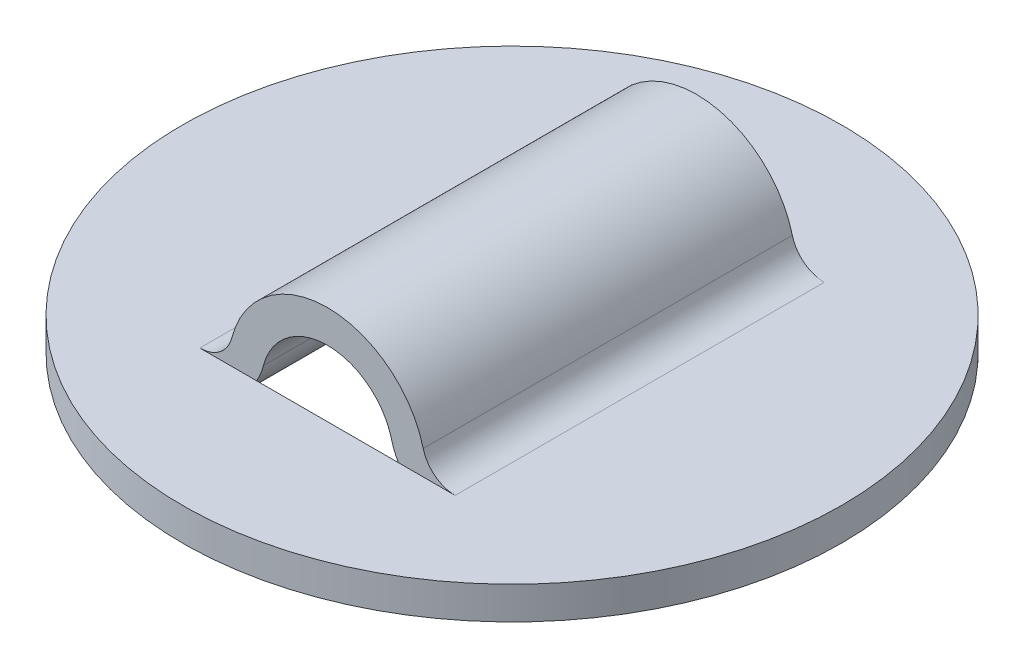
ISO-10303-21;
HEADER;
FILE_DESCRIPTION(('STEP AP214'),'2;1');
FILE_NAME('part.step','',(''),(''),'','','');
FILE_SCHEMA(('AUTOMOTIVE_DESIGN { 1 0 10303 214 1 1 1 1 }'));
ENDSEC;
DATA;
#1=APPLICATION_CONTEXT('core data for automotive mechanical design processes');
#2=APPLICATION_PROTOCOL_DEFINITION('international standard','automotive_design',2000,#1);
#3=PRODUCT_CONTEXT('',#1,'mechanical');
#4=PRODUCT('Part','Part','',(#3));
#5=PRODUCT_RELATED_PRODUCT_CATEGORY('part','',(#4));
#6=PRODUCT_DEFINITION_FORMATION('','',#4);
#7=PRODUCT_DEFINITION_CONTEXT('part definition',#1,'design');
#8=PRODUCT_DEFINITION('design','',#6,#7);
#9=PRODUCT_DEFINITION_SHAPE('','',#8);
#10=(LENGTH_UNIT() NAMED_UNIT(*) SI_UNIT(.MILLI.,.METRE.));
#11=(NAMED_UNIT(*) PLANE_ANGLE_UNIT() SI_UNIT($,.RADIAN.));
#12=(NAMED_UNIT(*) SI_UNIT($,.STERADIAN.) SOLID_ANGLE_UNIT());
#13=UNCERTAINTY_MEASURE_WITH_UNIT(LENGTH_MEASURE(1.E-05),#10,'distance_accuracy_value','');
#14=(GEOMETRIC_REPRESENTATION_CONTEXT(3) GLOBAL_UNCERTAINTY_ASSIGNED_CONTEXT((#13)) GLOBAL_UNIT_ASSIGNED_CONTEXT((#10,
#11,#12)) REPRESENTATION_CONTEXT('',''));
#15=CARTESIAN_POINT('',(0.,0.,0.));
#16=DIRECTION('',(0.,0.,1.));
#17=DIRECTION('',(1.,0.,0.));
#18=AXIS2_PLACEMENT_3D('',#15,#16,#17);
#19=CARTESIAN_POINT('',(0.,0.,17.78));
#20=DIRECTION('',(0.,0.,-1.));
#21=DIRECTION('',(-1.,0.,0.));
#22=AXIS2_PLACEMENT_3D('',#19,#20,#21);
#23=CYLINDRICAL_SURFACE('',#22,4.7625);
#24=CARTESIAN_POINT('',(0.,0.,0.));
#25=DIRECTION('',(0.,0.,-1.));
#26=DIRECTION('',(-1.,0.,0.));
#27=AXIS2_PLACEMENT_3D('',#24,#25,#26);
#28=CIRCLE('',#27,4.7625);
#29=CARTESIAN_POINT('',(-4.61127079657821,1.190625,0.));
#30=VERTEX_POINT('',#29);
#31=CARTESIAN_POINT('',(4.61127079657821,1.190625,0.));
#32=VERTEX_POINT('',#31);
#33=EDGE_CURVE('E163',#30,#32,#28,.T.);
#34=ORIENTED_EDGE('',*,*,#33,.F.);
#35=DIRECTION('',(0.,0.,-1.));
#36=VECTOR('',#35,1.);
#37=CARTESIAN_POINT('',(-4.61127079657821,1.190625,17.78));
#38=LINE('',#37,#36);
#39=CARTESIAN_POINT('',(-4.61127079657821,1.190625,17.78));
#40=VERTEX_POINT('',#39);
#41=EDGE_CURVE('E126',#30,#40,#38,.F.);
#42=ORIENTED_EDGE('',*,*,#41,.T.);
#43=CARTESIAN_POINT('',(0.,0.,17.78));
#44=DIRECTION('',(0.,0.,-1.));
#45=DIRECTION('',(-1.,0.,0.));
#46=AXIS2_PLACEMENT_3D('',#43,#44,#45);
#47=CIRCLE('',#46,4.7625);
#48=CARTESIAN_POINT('',(4.61127079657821,1.190625,17.78));
#49=VERTEX_POINT('',#48);
#50=EDGE_CURVE('E98',#40,#49,#47,.T.);
#51=ORIENTED_EDGE('',*,*,#50,.T.);
#52=DIRECTION('',(0.,0.,-1.));
#53=VECTOR('',#52,1.);
#54=CARTESIAN_POINT('',(4.61127079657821,1.190625,17.78));
#55=LINE('',#54,#53);
#56=EDGE_CURVE('E101',#49,#32,#55,.T.);
#57=ORIENTED_EDGE('',*,*,#56,.T.);
#58=EDGE_LOOP('',(#34,#42,#51,#57));
#59=FACE_BOUND('',#58,.T.);
#60=ADVANCED_FACE('F18',(#59),#23,.T.);
#61=CARTESIAN_POINT('',(-6.14836106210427,1.5875,17.78));
#62=DIRECTION('',(0.,0.,-1.));
#63=DIRECTION('',(-1.,0.,0.));
#64=AXIS2_PLACEMENT_3D('',#61,#62,#63);
#65=CYLINDRICAL_SURFACE('',#64,1.5875);
#66=CARTESIAN_POINT('',(-6.14836106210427,1.5875,17.78));
#67=DIRECTION('',(0.,0.,-1.));
#68=DIRECTION('',(-1.,0.,0.));
#69=AXIS2_PLACEMENT_3D('',#66,#67,#68);
#70=CIRCLE('',#69,1.5875);
#71=CARTESIAN_POINT('',(-6.14836106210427,0.,17.78));
#72=VERTEX_POINT('',#71);
#73=EDGE_CURVE('E21',#72,#40,#70,.F.);
#74=ORIENTED_EDGE('',*,*,#73,.T.);
#75=ORIENTED_EDGE('',*,*,#41,.F.);
#76=CARTESIAN_POINT('',(-6.14836106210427,1.5875,0.));
#77=DIRECTION('',(0.,0.,-1.));
#78=DIRECTION('',(-1.,0.,0.));
#79=AXIS2_PLACEMENT_3D('',#76,#77,#78);
#80=CIRCLE('',#79,1.5875);
#81=CARTESIAN_POINT('',(-6.14836106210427,0.,0.));
#82=VERTEX_POINT('',#81);
#83=EDGE_CURVE('E117',#82,#30,#80,.F.);
#84=ORIENTED_EDGE('',*,*,#83,.F.);
#85=DIRECTION('',(0.,0.,1.));
#86=VECTOR('',#85,1.);
#87=CARTESIAN_POINT('',(-6.14836106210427,0.,17.78));
#88=LINE('',#87,#86);
#89=EDGE_CURVE('E108',#82,#72,#88,.T.);
#90=ORIENTED_EDGE('',*,*,#89,.T.);
#91=EDGE_LOOP('',(#74,#75,#84,#90));
#92=FACE_BOUND('',#91,.T.);
#93=ADVANCED_FACE('F115',(#92),#65,.F.);
#94=CARTESIAN_POINT('',(6.14836106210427,1.5875,17.78));
#95=DIRECTION('',(0.,0.,-1.));
#96=DIRECTION('',(-1.,0.,0.));
#97=AXIS2_PLACEMENT_3D('',#94,#95,#96);
#98=CYLINDRICAL_SURFACE('',#97,1.5875);
#99=CARTESIAN_POINT('',(6.14836106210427,1.5875,17.78));
#100=DIRECTION('',(0.,0.,-1.));
#101=DIRECTION('',(-1.,0.,0.));
#102=AXIS2_PLACEMENT_3D('',#99,#100,#101);
#103=CIRCLE('',#102,1.5875);
#104=CARTESIAN_POINT('',(6.14836106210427,0.,17.78));
#105=VERTEX_POINT('',#104);
#106=EDGE_CURVE('E169',#49,#105,#103,.F.);
#107=ORIENTED_EDGE('',*,*,#106,.T.);
#108=DIRECTION('',(0.,0.,1.));
#109=VECTOR('',#108,1.);
#110=CARTESIAN_POINT('',(6.14836106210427,0.,17.78));
#111=LINE('',#110,#109);
#112=CARTESIAN_POINT('',(6.14836106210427,0.,0.));
#113=VERTEX_POINT('',#112);
#114=EDGE_CURVE('E124',#105,#113,#111,.F.);
#115=ORIENTED_EDGE('',*,*,#114,.T.);
#116=CARTESIAN_POINT('',(6.14836106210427,1.5875,0.));
#117=DIRECTION('',(0.,0.,-1.));
#118=DIRECTION('',(-1.,0.,0.));
#119=AXIS2_PLACEMENT_3D('',#116,#117,#118);
#120=CIRCLE('',#119,1.5875);
#121=EDGE_CURVE('E167',#32,#113,#120,.F.);
#122=ORIENTED_EDGE('',*,*,#121,.F.);
#123=ORIENTED_EDGE('',*,*,#56,.F.);
#124=EDGE_LOOP('',(#107,#115,#122,#123));
#125=FACE_BOUND('',#124,.T.);
#126=ADVANCED_FACE('F205',(#125),#98,.F.);
#127=CARTESIAN_POINT('',(-6.14836106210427,1.5875,17.78));
#128=DIRECTION('',(0.,0.,-1.));
#129=DIRECTION('',(-1.,0.,0.));
#130=AXIS2_PLACEMENT_3D('',#127,#128,#129);
#131=PLANE('',#130);
#132=ORIENTED_EDGE('',*,*,#106,.F.);
#133=ORIENTED_EDGE('',*,*,#50,.F.);
#134=ORIENTED_EDGE('',*,*,#73,.F.);
#135=DIRECTION('',(1.,0.,0.));
#136=VECTOR('',#135,1.);
#137=CARTESIAN_POINT('',(6.14836106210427,0.,17.78));
#138=LINE('',#137,#136);
#139=CARTESIAN_POINT('',(-3.41340493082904,0.,17.78));
#140=VERTEX_POINT('',#139);
#141=EDGE_CURVE('E95',#72,#140,#138,.T.);
#142=ORIENTED_EDGE('',*,*,#141,.T.);
#143=CARTESIAN_POINT('',(-6.14836106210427,1.5875,17.78));
#144=DIRECTION('',(0.,0.,-1.));
#145=DIRECTION('',(-1.,0.,0.));
#146=AXIS2_PLACEMENT_3D('',#143,#144,#145);
#147=CIRCLE('',#146,3.1623);
#148=CARTESIAN_POINT('',(-3.08647725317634,0.796924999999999,17.78));
#149=VERTEX_POINT('',#148);
#150=EDGE_CURVE('E144',#149,#140,#147,.T.);
#151=ORIENTED_EDGE('',*,*,#150,.F.);
#152=CARTESIAN_POINT('',(0.,0.,17.78));
#153=DIRECTION('',(0.,0.,-1.));
#154=DIRECTION('',(-1.,0.,0.));
#155=AXIS2_PLACEMENT_3D('',#152,#153,#154);
#156=CIRCLE('',#155,3.1877);
#157=CARTESIAN_POINT('',(3.08647725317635,0.796925,17.78));
#158=VERTEX_POINT('',#157);
#159=EDGE_CURVE('E120',#149,#158,#156,.T.);
#160=ORIENTED_EDGE('',*,*,#159,.T.);
#161=CARTESIAN_POINT('',(6.14836106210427,1.5875,17.78));
#162=DIRECTION('',(0.,0.,-1.));
#163=DIRECTION('',(-1.,0.,0.));
#164=AXIS2_PLACEMENT_3D('',#161,#162,#163);
#165=CIRCLE('',#164,3.1623);
#166=CARTESIAN_POINT('',(3.41340493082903,0.,17.78));
#167=VERTEX_POINT('',#166);
#168=EDGE_CURVE('E149',#167,#158,#165,.T.);
#169=ORIENTED_EDGE('',*,*,#168,.F.);
#170=DIRECTION('',(1.,0.,0.));
#171=VECTOR('',#170,1.);
#172=CARTESIAN_POINT('',(6.14836106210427,0.,17.78));
#173=LINE('',#172,#171);
#174=EDGE_CURVE('E113',#167,#105,#173,.T.);
#175=ORIENTED_EDGE('',*,*,#174,.T.);
#176=EDGE_LOOP('',(#132,#133,#134,#142,#151,#160,#169,#175));
#177=FACE_BOUND('',#176,.T.);
#178=ADVANCED_FACE('F93',(#177),#131,.F.);
#179=CARTESIAN_POINT('',(-6.14836106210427,1.5875,0.));
#180=DIRECTION('',(0.,0.,-1.));
#181=DIRECTION('',(-1.,0.,0.));
#182=AXIS2_PLACEMENT_3D('',#179,#180,#181);
#183=PLANE('',#182);
#184=ORIENTED_EDGE('',*,*,#83,.T.);
#185=ORIENTED_EDGE('',*,*,#33,.T.);
#186=ORIENTED_EDGE('',*,*,#121,.T.);
#187=DIRECTION('',(1.,0.,0.));
#188=VECTOR('',#187,1.);
#189=CARTESIAN_POINT('',(6.14836106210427,0.,0.));
#190=LINE('',#189,#188);
#191=CARTESIAN_POINT('',(3.41340493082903,0.,0.));
#192=VERTEX_POINT('',#191);
#193=EDGE_CURVE('E157',#113,#192,#190,.F.);
#194=ORIENTED_EDGE('',*,*,#193,.T.);
#195=CARTESIAN_POINT('',(6.14836106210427,1.5875,0.));
#196=DIRECTION('',(0.,0.,-1.));
#197=DIRECTION('',(-1.,0.,0.));
#198=AXIS2_PLACEMENT_3D('',#195,#196,#197);
#199=CIRCLE('',#198,3.1623);
#200=CARTESIAN_POINT('',(3.08647725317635,0.796925,0.));
#201=VERTEX_POINT('',#200);
#202=EDGE_CURVE('E152',#201,#192,#199,.F.);
#203=ORIENTED_EDGE('',*,*,#202,.F.);
#204=CARTESIAN_POINT('',(0.,0.,0.));
#205=DIRECTION('',(0.,0.,-1.));
#206=DIRECTION('',(-1.,0.,0.));
#207=AXIS2_PLACEMENT_3D('',#204,#205,#206);
#208=CIRCLE('',#207,3.1877);
#209=CARTESIAN_POINT('',(-3.08647725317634,0.796924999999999,0.));
#210=VERTEX_POINT('',#209);
#211=EDGE_CURVE('E160',#201,#210,#208,.F.);
#212=ORIENTED_EDGE('',*,*,#211,.T.);
#213=CARTESIAN_POINT('',(-6.14836106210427,1.5875,0.));
#214=DIRECTION('',(0.,0.,-1.));
#215=DIRECTION('',(-1.,0.,0.));
#216=AXIS2_PLACEMENT_3D('',#213,#214,#215);
#217=CIRCLE('',#216,3.1623);
#218=CARTESIAN_POINT('',(-3.41340493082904,0.,0.));
#219=VERTEX_POINT('',#218);
#220=EDGE_CURVE('E139',#219,#210,#217,.F.);
#221=ORIENTED_EDGE('',*,*,#220,.F.);
#222=DIRECTION('',(1.,0.,0.));
#223=VECTOR('',#222,1.);
#224=CARTESIAN_POINT('',(6.14836106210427,0.,0.));
#225=LINE('',#224,#223);
#226=EDGE_CURVE('E118',#219,#82,#225,.F.);
#227=ORIENTED_EDGE('',*,*,#226,.T.);
#228=EDGE_LOOP('',(#184,#185,#186,#194,#203,#212,#221,#227));
#229=FACE_BOUND('',#228,.T.);
#230=ADVANCED_FACE('F173',(#229),#183,.T.);
#231=CARTESIAN_POINT('',(0.,0.,17.78));
#232=DIRECTION('',(0.,0.,-1.));
#233=DIRECTION('',(-1.,0.,0.));
#234=AXIS2_PLACEMENT_3D('',#231,#232,#233);
#235=CYLINDRICAL_SURFACE('',#234,3.1877);
#236=ORIENTED_EDGE('',*,*,#159,.F.);
#237=DIRECTION('',(0.,0.,-1.));
#238=VECTOR('',#237,1.);
#239=CARTESIAN_POINT('',(-3.08647725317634,0.796925,17.78));
#240=LINE('',#239,#238);
#241=EDGE_CURVE('E141',#210,#149,#240,.F.);
#242=ORIENTED_EDGE('',*,*,#241,.F.);
#243=ORIENTED_EDGE('',*,*,#211,.F.);
#244=DIRECTION('',(0.,0.,-1.));
#245=VECTOR('',#244,1.);
#246=CARTESIAN_POINT('',(3.08647725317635,0.796925,17.78));
#247=LINE('',#246,#245);
#248=EDGE_CURVE('E151',#158,#201,#247,.T.);
#249=ORIENTED_EDGE('',*,*,#248,.F.);
#250=EDGE_LOOP('',(#236,#242,#243,#249));
#251=FACE_BOUND('',#250,.T.);
#252=ADVANCED_FACE('F226',(#251),#235,.F.);
#253=CARTESIAN_POINT('',(6.14836106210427,0.,17.78));
#254=DIRECTION('',(0.,-1.,0.));
#255=DIRECTION('',(1.,0.,0.));
#256=AXIS2_PLACEMENT_3D('',#253,#254,#255);
#257=PLANE('',#256);
#258=ORIENTED_EDGE('',*,*,#193,.F.);
#259=ORIENTED_EDGE('',*,*,#114,.F.);
#260=ORIENTED_EDGE('',*,*,#174,.F.);
#261=DIRECTION('',(1.,0.,0.));
#262=VECTOR('',#261,1.);
#263=CARTESIAN_POINT('',(6.14836106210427,0.,17.78));
#264=LINE('',#263,#262);
#265=EDGE_CURVE('E111',#167,#140,#264,.F.);
#266=ORIENTED_EDGE('',*,*,#265,.T.);
#267=ORIENTED_EDGE('',*,*,#141,.F.);
#268=ORIENTED_EDGE('',*,*,#89,.F.);
#269=ORIENTED_EDGE('',*,*,#226,.F.);
#270=DIRECTION('',(1.,0.,0.));
#271=VECTOR('',#270,1.);
#272=CARTESIAN_POINT('',(6.14836106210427,0.,0.));
#273=LINE('',#272,#271);
#274=EDGE_CURVE('E138',#192,#219,#273,.F.);
#275=ORIENTED_EDGE('',*,*,#274,.F.);
#276=EDGE_LOOP('',(#258,#259,#260,#266,#267,#268,#269,#275));
#277=FACE_BOUND('',#276,.T.);
#278=CARTESIAN_POINT('',(0.,0.,8.89));
#279=DIRECTION('',(0.,-1.,0.));
#280=DIRECTION('',(1.,0.,0.));
#281=AXIS2_PLACEMENT_3D('',#278,#279,#280);
#282=CIRCLE('',#281,15.875);
#283=CARTESIAN_POINT('',(15.875,0.,8.89));
#284=VERTEX_POINT('',#283);
#285=EDGE_CURVE('E154',#284,#284,#282,.T.);
#286=ORIENTED_EDGE('',*,*,#285,.F.);
#287=EDGE_LOOP('',(#286));
#288=FACE_BOUND('',#287,.T.);
#289=ADVANCED_FACE('F106',(#277,#288),#257,.F.);
#290=CARTESIAN_POINT('',(0.,0.,8.89));
#291=DIRECTION('',(0.,-1.,0.));
#292=DIRECTION('',(1.,0.,0.));
#293=AXIS2_PLACEMENT_3D('',#290,#291,#292);
#294=CYLINDRICAL_SURFACE('',#293,15.875);
#295=CARTESIAN_POINT('',(0.,-1.5748,8.89));
#296=DIRECTION('',(0.,-1.,0.));
#297=DIRECTION('',(1.,0.,0.));
#298=AXIS2_PLACEMENT_3D('',#295,#296,#297);
#299=CIRCLE('',#298,15.875);
#300=CARTESIAN_POINT('',(15.875,-1.5748,8.89));
#301=VERTEX_POINT('',#300);
#302=EDGE_CURVE('E130',#301,#301,#299,.F.);
#303=ORIENTED_EDGE('',*,*,#302,.T.);
#304=EDGE_LOOP('',(#303));
#305=FACE_BOUND('',#304,.T.);
#306=ORIENTED_EDGE('',*,*,#285,.T.);
#307=EDGE_LOOP('',(#306));
#308=FACE_BOUND('',#307,.T.);
#309=ADVANCED_FACE('F220',(#305,#308),#294,.T.);
#310=CARTESIAN_POINT('',(6.14836106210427,1.5875,17.78));
#311=DIRECTION('',(0.,0.,-1.));
#312=DIRECTION('',(-1.,0.,0.));
#313=AXIS2_PLACEMENT_3D('',#310,#311,#312);
#314=CYLINDRICAL_SURFACE('',#313,3.1623);
#315=ORIENTED_EDGE('',*,*,#168,.T.);
#316=ORIENTED_EDGE('',*,*,#248,.T.);
#317=ORIENTED_EDGE('',*,*,#202,.T.);
#318=CARTESIAN_POINT('',(6.14836106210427,1.5875,0.));
#319=DIRECTION('',(0.,0.,-1.));
#320=DIRECTION('',(-1.,0.,0.));
#321=AXIS2_PLACEMENT_3D('',#318,#319,#320);
#322=CIRCLE('',#321,3.1623);
#323=CARTESIAN_POINT('',(6.14836106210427,-1.5748,0.));
#324=VERTEX_POINT('',#323);
#325=EDGE_CURVE('E134',#324,#192,#322,.T.);
#326=ORIENTED_EDGE('',*,*,#325,.F.);
#327=DIRECTION('',(0.,0.,1.));
#328=VECTOR('',#327,1.);
#329=CARTESIAN_POINT('',(6.14836106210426,-1.5748,17.78));
#330=LINE('',#329,#328);
#331=CARTESIAN_POINT('',(6.14836106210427,-1.5748,17.78));
#332=VERTEX_POINT('',#331);
#333=EDGE_CURVE('E133',#324,#332,#330,.T.);
#334=ORIENTED_EDGE('',*,*,#333,.T.);
#335=CARTESIAN_POINT('',(6.14836106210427,1.5875,17.78));
#336=DIRECTION('',(0.,0.,-1.));
#337=DIRECTION('',(-1.,0.,0.));
#338=AXIS2_PLACEMENT_3D('',#335,#336,#337);
#339=CIRCLE('',#338,3.1623);
#340=EDGE_CURVE('E146',#332,#167,#339,.T.);
#341=ORIENTED_EDGE('',*,*,#340,.T.);
#342=EDGE_LOOP('',(#315,#316,#317,#326,#334,#341));
#343=FACE_BOUND('',#342,.T.);
#344=ADVANCED_FACE('F198',(#343),#314,.T.);
#345=CARTESIAN_POINT('',(6.14836106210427,1.5875,17.78));
#346=DIRECTION('',(0.,0.,1.));
#347=DIRECTION('',(1.,0.,0.));
#348=AXIS2_PLACEMENT_3D('',#345,#346,#347);
#349=PLANE('',#348);
#350=DIRECTION('',(1.,0.,0.));
#351=VECTOR('',#350,1.);
#352=CARTESIAN_POINT('',(-15.875,-1.5748,17.78));
#353=LINE('',#352,#351);
#354=CARTESIAN_POINT('',(-6.14836106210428,-1.5748,17.78));
#355=VERTEX_POINT('',#354);
#356=EDGE_CURVE('E184',#332,#355,#353,.F.);
#357=ORIENTED_EDGE('',*,*,#356,.T.);
#358=CARTESIAN_POINT('',(-6.14836106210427,1.5875,17.78));
#359=DIRECTION('',(0.,0.,-1.));
#360=DIRECTION('',(-1.,0.,0.));
#361=AXIS2_PLACEMENT_3D('',#358,#359,#360);
#362=CIRCLE('',#361,3.1623);
#363=EDGE_CURVE('E142',#140,#355,#362,.T.);
#364=ORIENTED_EDGE('',*,*,#363,.F.);
#365=ORIENTED_EDGE('',*,*,#265,.F.);
#366=ORIENTED_EDGE('',*,*,#340,.F.);
#367=EDGE_LOOP('',(#357,#364,#365,#366));
#368=FACE_BOUND('',#367,.T.);
#369=ADVANCED_FACE('F207',(#368),#349,.F.);
#370=CARTESIAN_POINT('',(-6.14836106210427,1.5875,17.78));
#371=DIRECTION('',(0.,0.,-1.));
#372=DIRECTION('',(-1.,0.,0.));
#373=AXIS2_PLACEMENT_3D('',#370,#371,#372);
#374=CYLINDRICAL_SURFACE('',#373,3.1623);
#375=ORIENTED_EDGE('',*,*,#220,.T.);
#376=ORIENTED_EDGE('',*,*,#241,.T.);
#377=ORIENTED_EDGE('',*,*,#150,.T.);
#378=ORIENTED_EDGE('',*,*,#363,.T.);
#379=DIRECTION('',(0.,0.,1.));
#380=VECTOR('',#379,1.);
#381=CARTESIAN_POINT('',(-6.14836106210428,-1.5748,17.78));
#382=LINE('',#381,#380);
#383=CARTESIAN_POINT('',(-6.14836106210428,-1.5748,0.));
#384=VERTEX_POINT('',#383);
#385=EDGE_CURVE('E27',#355,#384,#382,.F.);
#386=ORIENTED_EDGE('',*,*,#385,.T.);
#387=CARTESIAN_POINT('',(-6.14836106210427,1.5875,0.));
#388=DIRECTION('',(0.,0.,-1.));
#389=DIRECTION('',(-1.,0.,0.));
#390=AXIS2_PLACEMENT_3D('',#387,#388,#389);
#391=CIRCLE('',#390,3.1623);
#392=EDGE_CURVE('E35',#219,#384,#391,.T.);
#393=ORIENTED_EDGE('',*,*,#392,.F.);
#394=EDGE_LOOP('',(#375,#376,#377,#378,#386,#393));
#395=FACE_BOUND('',#394,.T.);
#396=ADVANCED_FACE('F211',(#395),#374,.T.);
#397=CARTESIAN_POINT('',(6.14836106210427,1.5875,0.));
#398=DIRECTION('',(0.,0.,1.));
#399=DIRECTION('',(1.,0.,0.));
#400=AXIS2_PLACEMENT_3D('',#397,#398,#399);
#401=PLANE('',#400);
#402=DIRECTION('',(1.,0.,0.));
#403=VECTOR('',#402,1.);
#404=CARTESIAN_POINT('',(-15.875,-1.5748,0.));
#405=LINE('',#404,#403);
#406=EDGE_CURVE('E11',#384,#324,#405,.T.);
#407=ORIENTED_EDGE('',*,*,#406,.T.);
#408=ORIENTED_EDGE('',*,*,#325,.T.);
#409=ORIENTED_EDGE('',*,*,#274,.T.);
#410=ORIENTED_EDGE('',*,*,#392,.T.);
#411=EDGE_LOOP('',(#407,#408,#409,#410));
#412=FACE_BOUND('',#411,.T.);
#413=ADVANCED_FACE('F177',(#412),#401,.T.);
#414=CARTESIAN_POINT('',(-15.875,-1.5748,17.78));
#415=DIRECTION('',(0.,1.,0.));
#416=DIRECTION('',(0.,0.,1.));
#417=AXIS2_PLACEMENT_3D('',#414,#415,#416);
#418=PLANE('',#417);
#419=ORIENTED_EDGE('',*,*,#385,.F.);
#420=ORIENTED_EDGE('',*,*,#356,.F.);
#421=ORIENTED_EDGE('',*,*,#333,.F.);
#422=ORIENTED_EDGE('',*,*,#406,.F.);
#423=EDGE_LOOP('',(#419,#420,#421,#422));
#424=FACE_BOUND('',#423,.T.);
#425=ORIENTED_EDGE('',*,*,#302,.F.);
#426=EDGE_LOOP('',(#425));
#427=FACE_BOUND('',#426,.T.);
#428=ADVANCED_FACE('F213',(#424,#427),#418,.F.);
#429=CLOSED_SHELL('',(#60,#93,#126,#178,#230,#252,#289,#309,#344,#369,#396,#413,#428));
#430=MANIFOLD_SOLID_BREP('B1',#429);
#431=ADVANCED_BREP_SHAPE_REPRESENTATION('',(#18,#430),#14);
#432=SHAPE_DEFINITION_REPRESENTATION(#9,#431);
ENDSEC;
END-ISO-10303-21;
